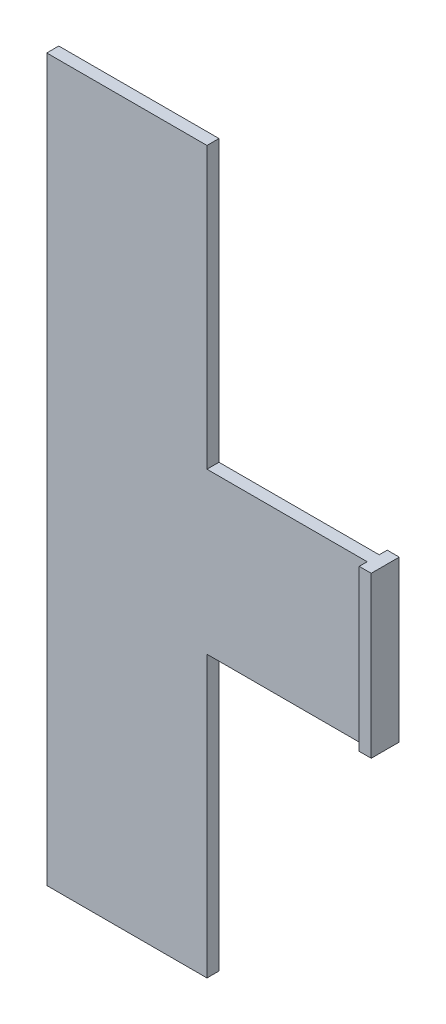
ISO-10303-21;
HEADER;
FILE_DESCRIPTION(('STEP AP214'),'2;1');
FILE_NAME('part.step','',(''),(''),'','','');
FILE_SCHEMA(('AUTOMOTIVE_DESIGN { 1 0 10303 214 1 1 1 1 }'));
ENDSEC;
DATA;
#1=APPLICATION_CONTEXT('core data for automotive mechanical design processes');
#2=APPLICATION_PROTOCOL_DEFINITION('international standard','automotive_design',2000,#1);
#3=PRODUCT_CONTEXT('',#1,'mechanical');
#4=PRODUCT('Part','Part','',(#3));
#5=PRODUCT_RELATED_PRODUCT_CATEGORY('part','',(#4));
#6=PRODUCT_DEFINITION_FORMATION('','',#4);
#7=PRODUCT_DEFINITION_CONTEXT('part definition',#1,'design');
#8=PRODUCT_DEFINITION('design','',#6,#7);
#9=PRODUCT_DEFINITION_SHAPE('','',#8);
#10=(LENGTH_UNIT() NAMED_UNIT(*) SI_UNIT(.MILLI.,.METRE.));
#11=(NAMED_UNIT(*) PLANE_ANGLE_UNIT() SI_UNIT($,.RADIAN.));
#12=(NAMED_UNIT(*) SI_UNIT($,.STERADIAN.) SOLID_ANGLE_UNIT());
#13=UNCERTAINTY_MEASURE_WITH_UNIT(LENGTH_MEASURE(1.E-05),#10,'distance_accuracy_value','');
#14=(GEOMETRIC_REPRESENTATION_CONTEXT(3) GLOBAL_UNCERTAINTY_ASSIGNED_CONTEXT((#13)) GLOBAL_UNIT_ASSIGNED_CONTEXT((#10,
#11,#12)) REPRESENTATION_CONTEXT('',''));
#15=CARTESIAN_POINT('',(0.,0.,0.));
#16=DIRECTION('',(0.,0.,1.));
#17=DIRECTION('',(1.,0.,0.));
#18=AXIS2_PLACEMENT_3D('',#15,#16,#17);
#19=CARTESIAN_POINT('',(0.,180.,0.));
#20=DIRECTION('',(-1.,0.,0.));
#21=DIRECTION('',(0.,0.,1.));
#22=AXIS2_PLACEMENT_3D('',#19,#20,#21);
#23=PLANE('',#22);
#24=DIRECTION('',(0.,0.,1.));
#25=VECTOR('',#24,1.);
#26=CARTESIAN_POINT('',(0.,110.,-3.00000000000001));
#27=LINE('',#26,#25);
#28=CARTESIAN_POINT('',(0.,110.,-3.00000000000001));
#29=VERTEX_POINT('',#28);
#30=CARTESIAN_POINT('',(0.,110.,0.));
#31=VERTEX_POINT('',#30);
#32=EDGE_CURVE('E122',#29,#31,#27,.T.);
#33=ORIENTED_EDGE('',*,*,#32,.F.);
#34=DIRECTION('',(0.,-1.,0.));
#35=VECTOR('',#34,1.);
#36=CARTESIAN_POINT('',(0.,180.,-3.00000000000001));
#37=LINE('',#36,#35);
#38=CARTESIAN_POINT('',(0.,180.,-3.00000000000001));
#39=VERTEX_POINT('',#38);
#40=EDGE_CURVE('E204',#39,#29,#37,.T.);
#41=ORIENTED_EDGE('',*,*,#40,.F.);
#42=DIRECTION('',(0.,0.,-1.));
#43=VECTOR('',#42,1.);
#44=CARTESIAN_POINT('',(0.,180.,0.));
#45=LINE('',#44,#43);
#46=CARTESIAN_POINT('',(0.,180.,0.));
#47=VERTEX_POINT('',#46);
#48=EDGE_CURVE('E124',#47,#39,#45,.T.);
#49=ORIENTED_EDGE('',*,*,#48,.F.);
#50=DIRECTION('',(0.,-1.,0.));
#51=VECTOR('',#50,1.);
#52=CARTESIAN_POINT('',(0.,180.,0.));
#53=LINE('',#52,#51);
#54=EDGE_CURVE('E11',#47,#31,#53,.T.);
#55=ORIENTED_EDGE('',*,*,#54,.T.);
#56=EDGE_LOOP('',(#33,#41,#49,#55));
#57=FACE_BOUND('',#56,.T.);
#58=ADVANCED_FACE('F33',(#57),#23,.F.);
#59=CARTESIAN_POINT('',(-40.,180.,0.));
#60=DIRECTION('',(0.,0.,-1.));
#61=DIRECTION('',(-1.,0.,0.));
#62=AXIS2_PLACEMENT_3D('',#59,#60,#61);
#63=PLANE('',#62);
#64=DIRECTION('',(1.,0.,0.));
#65=VECTOR('',#64,1.);
#66=CARTESIAN_POINT('',(-40.,0.,0.));
#67=LINE('',#66,#65);
#68=CARTESIAN_POINT('',(-40.,0.,0.));
#69=VERTEX_POINT('',#68);
#70=CARTESIAN_POINT('',(0.,0.,0.));
#71=VERTEX_POINT('',#70);
#72=EDGE_CURVE('E184',#69,#71,#67,.T.);
#73=ORIENTED_EDGE('',*,*,#72,.T.);
#74=CARTESIAN_POINT('',(0.,70.,0.));
#75=VERTEX_POINT('',#74);
#76=EDGE_CURVE('E41',#75,#71,#53,.T.);
#77=ORIENTED_EDGE('',*,*,#76,.F.);
#78=DIRECTION('',(1.,0.,0.));
#79=VECTOR('',#78,1.);
#80=CARTESIAN_POINT('',(0.,70.,0.));
#81=LINE('',#80,#79);
#82=CARTESIAN_POINT('',(40.,70.,0.));
#83=VERTEX_POINT('',#82);
#84=EDGE_CURVE('E158',#75,#83,#81,.T.);
#85=ORIENTED_EDGE('',*,*,#84,.T.);
#86=DIRECTION('',(0.,-1.,0.));
#87=VECTOR('',#86,1.);
#88=CARTESIAN_POINT('',(40.,110.,0.));
#89=LINE('',#88,#87);
#90=CARTESIAN_POINT('',(40.,110.,0.));
#91=VERTEX_POINT('',#90);
#92=EDGE_CURVE('E132',#91,#83,#89,.T.);
#93=ORIENTED_EDGE('',*,*,#92,.F.);
#94=DIRECTION('',(1.,0.,0.));
#95=VECTOR('',#94,1.);
#96=CARTESIAN_POINT('',(0.,110.,0.));
#97=LINE('',#96,#95);
#98=EDGE_CURVE('E129',#31,#91,#97,.T.);
#99=ORIENTED_EDGE('',*,*,#98,.F.);
#100=ORIENTED_EDGE('',*,*,#54,.F.);
#101=DIRECTION('',(1.,0.,0.));
#102=VECTOR('',#101,1.);
#103=CARTESIAN_POINT('',(-40.,180.,0.));
#104=LINE('',#103,#102);
#105=CARTESIAN_POINT('',(-40.,180.,0.));
#106=VERTEX_POINT('',#105);
#107=EDGE_CURVE('E185',#106,#47,#104,.T.);
#108=ORIENTED_EDGE('',*,*,#107,.F.);
#109=DIRECTION('',(0.,-1.,0.));
#110=VECTOR('',#109,1.);
#111=CARTESIAN_POINT('',(-40.,180.,0.));
#112=LINE('',#111,#110);
#113=EDGE_CURVE('E193',#106,#69,#112,.T.);
#114=ORIENTED_EDGE('',*,*,#113,.T.);
#115=EDGE_LOOP('',(#73,#77,#85,#93,#99,#100,#108,#114));
#116=FACE_BOUND('',#115,.T.);
#117=ADVANCED_FACE('F35',(#116),#63,.F.);
#118=CARTESIAN_POINT('',(0.,70.,-3.00000000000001));
#119=VERTEX_POINT('',#118);
#120=CARTESIAN_POINT('',(0.,0.,-3.00000000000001));
#121=VERTEX_POINT('',#120);
#122=EDGE_CURVE('E53',#119,#121,#37,.T.);
#123=ORIENTED_EDGE('',*,*,#122,.F.);
#124=DIRECTION('',(0.,0.,1.));
#125=VECTOR('',#124,1.);
#126=CARTESIAN_POINT('',(0.,70.,-3.00000000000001));
#127=LINE('',#126,#125);
#128=EDGE_CURVE('E48',#119,#75,#127,.T.);
#129=ORIENTED_EDGE('',*,*,#128,.T.);
#130=ORIENTED_EDGE('',*,*,#76,.T.);
#131=DIRECTION('',(0.,0.,-1.));
#132=VECTOR('',#131,1.);
#133=CARTESIAN_POINT('',(0.,0.,0.));
#134=LINE('',#133,#132);
#135=EDGE_CURVE('E195',#71,#121,#134,.T.);
#136=ORIENTED_EDGE('',*,*,#135,.T.);
#137=EDGE_LOOP('',(#123,#129,#130,#136));
#138=FACE_BOUND('',#137,.T.);
#139=ADVANCED_FACE('F212',(#138),#23,.F.);
#140=CARTESIAN_POINT('',(0.,180.,-3.00000000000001));
#141=DIRECTION('',(0.,0.,1.));
#142=DIRECTION('',(1.,0.,0.));
#143=AXIS2_PLACEMENT_3D('',#140,#141,#142);
#144=PLANE('',#143);
#145=DIRECTION('',(-1.,0.,0.));
#146=VECTOR('',#145,1.);
#147=CARTESIAN_POINT('',(0.,0.,-3.00000000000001));
#148=LINE('',#147,#146);
#149=CARTESIAN_POINT('',(-40.,0.,-3.));
#150=VERTEX_POINT('',#149);
#151=EDGE_CURVE('E197',#121,#150,#148,.T.);
#152=ORIENTED_EDGE('',*,*,#151,.T.);
#153=DIRECTION('',(0.,-1.,0.));
#154=VECTOR('',#153,1.);
#155=CARTESIAN_POINT('',(-40.,180.,-3.));
#156=LINE('',#155,#154);
#157=CARTESIAN_POINT('',(-40.,180.,-3.));
#158=VERTEX_POINT('',#157);
#159=EDGE_CURVE('E202',#158,#150,#156,.T.);
#160=ORIENTED_EDGE('',*,*,#159,.F.);
#161=DIRECTION('',(-1.,0.,0.));
#162=VECTOR('',#161,1.);
#163=CARTESIAN_POINT('',(0.,180.,-3.00000000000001));
#164=LINE('',#163,#162);
#165=EDGE_CURVE('E189',#39,#158,#164,.T.);
#166=ORIENTED_EDGE('',*,*,#165,.F.);
#167=ORIENTED_EDGE('',*,*,#40,.T.);
#168=DIRECTION('',(-1.,0.,0.));
#169=VECTOR('',#168,1.);
#170=CARTESIAN_POINT('',(0.,110.,-3.00000000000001));
#171=LINE('',#170,#169);
#172=CARTESIAN_POINT('',(40.,110.,-3.00000000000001));
#173=VERTEX_POINT('',#172);
#174=EDGE_CURVE('E140',#173,#29,#171,.T.);
#175=ORIENTED_EDGE('',*,*,#174,.F.);
#176=DIRECTION('',(0.,-1.,0.));
#177=VECTOR('',#176,1.);
#178=CARTESIAN_POINT('',(40.,110.,-3.00000000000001));
#179=LINE('',#178,#177);
#180=CARTESIAN_POINT('',(40.,70.,-3.00000000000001));
#181=VERTEX_POINT('',#180);
#182=EDGE_CURVE('E156',#173,#181,#179,.T.);
#183=ORIENTED_EDGE('',*,*,#182,.T.);
#184=DIRECTION('',(-1.,0.,0.));
#185=VECTOR('',#184,1.);
#186=CARTESIAN_POINT('',(0.,70.,-3.00000000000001));
#187=LINE('',#186,#185);
#188=EDGE_CURVE('E141',#181,#119,#187,.T.);
#189=ORIENTED_EDGE('',*,*,#188,.T.);
#190=ORIENTED_EDGE('',*,*,#122,.T.);
#191=EDGE_LOOP('',(#152,#160,#166,#167,#175,#183,#189,#190));
#192=FACE_BOUND('',#191,.T.);
#193=ADVANCED_FACE('F207',(#192),#144,.F.);
#194=CARTESIAN_POINT('',(-40.,180.,-3.));
#195=DIRECTION('',(1.,0.,0.));
#196=DIRECTION('',(0.,0.,-1.));
#197=AXIS2_PLACEMENT_3D('',#194,#195,#196);
#198=PLANE('',#197);
#199=DIRECTION('',(0.,0.,1.));
#200=VECTOR('',#199,1.);
#201=CARTESIAN_POINT('',(-40.,0.,-3.));
#202=LINE('',#201,#200);
#203=EDGE_CURVE('E187',#150,#69,#202,.T.);
#204=ORIENTED_EDGE('',*,*,#203,.T.);
#205=ORIENTED_EDGE('',*,*,#113,.F.);
#206=DIRECTION('',(0.,0.,1.));
#207=VECTOR('',#206,1.);
#208=CARTESIAN_POINT('',(-40.,180.,-3.));
#209=LINE('',#208,#207);
#210=EDGE_CURVE('E191',#158,#106,#209,.T.);
#211=ORIENTED_EDGE('',*,*,#210,.F.);
#212=ORIENTED_EDGE('',*,*,#159,.T.);
#213=EDGE_LOOP('',(#204,#205,#211,#212));
#214=FACE_BOUND('',#213,.T.);
#215=ADVANCED_FACE('F219',(#214),#198,.F.);
#216=CARTESIAN_POINT('',(0.,180.,0.));
#217=DIRECTION('',(0.,1.,0.));
#218=DIRECTION('',(0.,0.,1.));
#219=AXIS2_PLACEMENT_3D('',#216,#217,#218);
#220=PLANE('',#219);
#221=ORIENTED_EDGE('',*,*,#107,.T.);
#222=ORIENTED_EDGE('',*,*,#48,.T.);
#223=ORIENTED_EDGE('',*,*,#165,.T.);
#224=ORIENTED_EDGE('',*,*,#210,.T.);
#225=EDGE_LOOP('',(#221,#222,#223,#224));
#226=FACE_BOUND('',#225,.T.);
#227=ADVANCED_FACE('F222',(#226),#220,.T.);
#228=CARTESIAN_POINT('',(0.,0.,0.));
#229=DIRECTION('',(0.,1.,0.));
#230=DIRECTION('',(0.,0.,1.));
#231=AXIS2_PLACEMENT_3D('',#228,#229,#230);
#232=PLANE('',#231);
#233=ORIENTED_EDGE('',*,*,#72,.F.);
#234=ORIENTED_EDGE('',*,*,#203,.F.);
#235=ORIENTED_EDGE('',*,*,#151,.F.);
#236=ORIENTED_EDGE('',*,*,#135,.F.);
#237=EDGE_LOOP('',(#233,#234,#235,#236));
#238=FACE_BOUND('',#237,.T.);
#239=ADVANCED_FACE('F216',(#238),#232,.F.);
#240=CARTESIAN_POINT('',(40.,110.,0.));
#241=DIRECTION('',(1.,0.,0.));
#242=DIRECTION('',(0.,0.,-1.));
#243=AXIS2_PLACEMENT_3D('',#240,#241,#242);
#244=PLANE('',#243);
#245=DIRECTION('',(0.,0.,1.));
#246=VECTOR('',#245,1.);
#247=CARTESIAN_POINT('',(40.,70.,0.));
#248=LINE('',#247,#246);
#249=CARTESIAN_POINT('',(40.,70.,1.99999999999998));
#250=VERTEX_POINT('',#249);
#251=EDGE_CURVE('E160',#83,#250,#248,.T.);
#252=ORIENTED_EDGE('',*,*,#251,.T.);
#253=DIRECTION('',(0.,-1.,0.));
#254=VECTOR('',#253,1.);
#255=CARTESIAN_POINT('',(40.,110.,1.99999999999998));
#256=LINE('',#255,#254);
#257=CARTESIAN_POINT('',(40.,110.,1.99999999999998));
#258=VERTEX_POINT('',#257);
#259=EDGE_CURVE('E180',#258,#250,#256,.T.);
#260=ORIENTED_EDGE('',*,*,#259,.F.);
#261=DIRECTION('',(0.,0.,1.));
#262=VECTOR('',#261,1.);
#263=CARTESIAN_POINT('',(40.,110.,0.));
#264=LINE('',#263,#262);
#265=EDGE_CURVE('E135',#91,#258,#264,.T.);
#266=ORIENTED_EDGE('',*,*,#265,.F.);
#267=ORIENTED_EDGE('',*,*,#92,.T.);
#268=EDGE_LOOP('',(#252,#260,#266,#267));
#269=FACE_BOUND('',#268,.T.);
#270=ADVANCED_FACE('F229',(#269),#244,.F.);
#271=CARTESIAN_POINT('',(40.,110.,1.99999999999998));
#272=DIRECTION('',(0.,0.,-1.));
#273=DIRECTION('',(-1.,0.,0.));
#274=AXIS2_PLACEMENT_3D('',#271,#272,#273);
#275=PLANE('',#274);
#276=DIRECTION('',(1.,0.,0.));
#277=VECTOR('',#276,1.);
#278=CARTESIAN_POINT('',(40.,70.,1.99999999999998));
#279=LINE('',#278,#277);
#280=CARTESIAN_POINT('',(43.,70.,1.99999999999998));
#281=VERTEX_POINT('',#280);
#282=EDGE_CURVE('E162',#250,#281,#279,.T.);
#283=ORIENTED_EDGE('',*,*,#282,.T.);
#284=DIRECTION('',(0.,-1.,0.));
#285=VECTOR('',#284,1.);
#286=CARTESIAN_POINT('',(43.,110.,1.99999999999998));
#287=LINE('',#286,#285);
#288=CARTESIAN_POINT('',(43.,110.,1.99999999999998));
#289=VERTEX_POINT('',#288);
#290=EDGE_CURVE('E177',#289,#281,#287,.T.);
#291=ORIENTED_EDGE('',*,*,#290,.F.);
#292=DIRECTION('',(1.,0.,0.));
#293=VECTOR('',#292,1.);
#294=CARTESIAN_POINT('',(40.,110.,1.99999999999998));
#295=LINE('',#294,#293);
#296=EDGE_CURVE('E147',#258,#289,#295,.T.);
#297=ORIENTED_EDGE('',*,*,#296,.F.);
#298=ORIENTED_EDGE('',*,*,#259,.T.);
#299=EDGE_LOOP('',(#283,#291,#297,#298));
#300=FACE_BOUND('',#299,.T.);
#301=ADVANCED_FACE('F290',(#300),#275,.F.);
#302=CARTESIAN_POINT('',(43.,110.,-5.00000000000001));
#303=DIRECTION('',(-1.,0.,0.));
#304=DIRECTION('',(0.,0.,1.));
#305=AXIS2_PLACEMENT_3D('',#302,#303,#304);
#306=PLANE('',#305);
#307=DIRECTION('',(0.,0.,-1.));
#308=VECTOR('',#307,1.);
#309=CARTESIAN_POINT('',(43.,70.,-5.00000000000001));
#310=LINE('',#309,#308);
#311=CARTESIAN_POINT('',(43.,70.,-5.00000000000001));
#312=VERTEX_POINT('',#311);
#313=EDGE_CURVE('E164',#281,#312,#310,.T.);
#314=ORIENTED_EDGE('',*,*,#313,.T.);
#315=DIRECTION('',(0.,-1.,0.));
#316=VECTOR('',#315,1.);
#317=CARTESIAN_POINT('',(43.,110.,-5.00000000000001));
#318=LINE('',#317,#316);
#319=CARTESIAN_POINT('',(43.,110.,-5.00000000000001));
#320=VERTEX_POINT('',#319);
#321=EDGE_CURVE('E174',#320,#312,#318,.T.);
#322=ORIENTED_EDGE('',*,*,#321,.F.);
#323=DIRECTION('',(0.,0.,-1.));
#324=VECTOR('',#323,1.);
#325=CARTESIAN_POINT('',(43.,110.,-5.00000000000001));
#326=LINE('',#325,#324);
#327=EDGE_CURVE('E149',#289,#320,#326,.T.);
#328=ORIENTED_EDGE('',*,*,#327,.F.);
#329=ORIENTED_EDGE('',*,*,#290,.T.);
#330=EDGE_LOOP('',(#314,#322,#328,#329));
#331=FACE_BOUND('',#330,.T.);
#332=ADVANCED_FACE('F298',(#331),#306,.F.);
#333=CARTESIAN_POINT('',(40.,110.,-5.00000000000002));
#334=DIRECTION('',(0.,0.,1.));
#335=DIRECTION('',(1.,0.,0.));
#336=AXIS2_PLACEMENT_3D('',#333,#334,#335);
#337=PLANE('',#336);
#338=DIRECTION('',(-1.,0.,0.));
#339=VECTOR('',#338,1.);
#340=CARTESIAN_POINT('',(40.,70.,-5.00000000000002));
#341=LINE('',#340,#339);
#342=CARTESIAN_POINT('',(40.,70.,-5.00000000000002));
#343=VERTEX_POINT('',#342);
#344=EDGE_CURVE('E166',#312,#343,#341,.T.);
#345=ORIENTED_EDGE('',*,*,#344,.T.);
#346=DIRECTION('',(0.,-1.,0.));
#347=VECTOR('',#346,1.);
#348=CARTESIAN_POINT('',(40.,110.,-5.00000000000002));
#349=LINE('',#348,#347);
#350=CARTESIAN_POINT('',(40.,110.,-5.00000000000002));
#351=VERTEX_POINT('',#350);
#352=EDGE_CURVE('E171',#351,#343,#349,.T.);
#353=ORIENTED_EDGE('',*,*,#352,.F.);
#354=DIRECTION('',(-1.,0.,0.));
#355=VECTOR('',#354,1.);
#356=CARTESIAN_POINT('',(40.,110.,-5.00000000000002));
#357=LINE('',#356,#355);
#358=EDGE_CURVE('E151',#320,#351,#357,.T.);
#359=ORIENTED_EDGE('',*,*,#358,.F.);
#360=ORIENTED_EDGE('',*,*,#321,.T.);
#361=EDGE_LOOP('',(#345,#353,#359,#360));
#362=FACE_BOUND('',#361,.T.);
#363=ADVANCED_FACE('F307',(#362),#337,.F.);
#364=CARTESIAN_POINT('',(40.,110.,-5.00000000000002));
#365=DIRECTION('',(1.,0.,0.));
#366=DIRECTION('',(0.,0.,-1.));
#367=AXIS2_PLACEMENT_3D('',#364,#365,#366);
#368=PLANE('',#367);
#369=DIRECTION('',(0.,0.,1.));
#370=VECTOR('',#369,1.);
#371=CARTESIAN_POINT('',(40.,70.,-5.00000000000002));
#372=LINE('',#371,#370);
#373=EDGE_CURVE('E143',#343,#181,#372,.T.);
#374=ORIENTED_EDGE('',*,*,#373,.T.);
#375=ORIENTED_EDGE('',*,*,#182,.F.);
#376=DIRECTION('',(0.,0.,1.));
#377=VECTOR('',#376,1.);
#378=CARTESIAN_POINT('',(40.,110.,-5.00000000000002));
#379=LINE('',#378,#377);
#380=EDGE_CURVE('E153',#351,#173,#379,.T.);
#381=ORIENTED_EDGE('',*,*,#380,.F.);
#382=ORIENTED_EDGE('',*,*,#352,.T.);
#383=EDGE_LOOP('',(#374,#375,#381,#382));
#384=FACE_BOUND('',#383,.T.);
#385=ADVANCED_FACE('F316',(#384),#368,.F.);
#386=CARTESIAN_POINT('',(0.,110.,0.));
#387=DIRECTION('',(0.,1.,0.));
#388=DIRECTION('',(0.,0.,1.));
#389=AXIS2_PLACEMENT_3D('',#386,#387,#388);
#390=PLANE('',#389);
#391=ORIENTED_EDGE('',*,*,#32,.T.);
#392=ORIENTED_EDGE('',*,*,#98,.T.);
#393=ORIENTED_EDGE('',*,*,#265,.T.);
#394=ORIENTED_EDGE('',*,*,#296,.T.);
#395=ORIENTED_EDGE('',*,*,#327,.T.);
#396=ORIENTED_EDGE('',*,*,#358,.T.);
#397=ORIENTED_EDGE('',*,*,#380,.T.);
#398=ORIENTED_EDGE('',*,*,#174,.T.);
#399=EDGE_LOOP('',(#391,#392,#393,#394,#395,#396,#397,#398));
#400=FACE_BOUND('',#399,.T.);
#401=ADVANCED_FACE('F138',(#400),#390,.T.);
#402=CARTESIAN_POINT('',(0.,70.,0.));
#403=DIRECTION('',(0.,1.,0.));
#404=DIRECTION('',(0.,0.,1.));
#405=AXIS2_PLACEMENT_3D('',#402,#403,#404);
#406=PLANE('',#405);
#407=ORIENTED_EDGE('',*,*,#128,.F.);
#408=ORIENTED_EDGE('',*,*,#188,.F.);
#409=ORIENTED_EDGE('',*,*,#373,.F.);
#410=ORIENTED_EDGE('',*,*,#344,.F.);
#411=ORIENTED_EDGE('',*,*,#313,.F.);
#412=ORIENTED_EDGE('',*,*,#282,.F.);
#413=ORIENTED_EDGE('',*,*,#251,.F.);
#414=ORIENTED_EDGE('',*,*,#84,.F.);
#415=EDGE_LOOP('',(#407,#408,#409,#410,#411,#412,#413,#414));
#416=FACE_BOUND('',#415,.T.);
#417=ADVANCED_FACE('F333',(#416),#406,.F.);
#418=CLOSED_SHELL('',(#58,#117,#139,#193,#215,#227,#239,#270,#301,#332,#363,#385,#401,#417));
#419=MANIFOLD_SOLID_BREP('B2',#418);
#420=ADVANCED_BREP_SHAPE_REPRESENTATION('',(#18,#419),#14);
#421=SHAPE_DEFINITION_REPRESENTATION(#9,#420);
ENDSEC;
END-ISO-10303-21;
